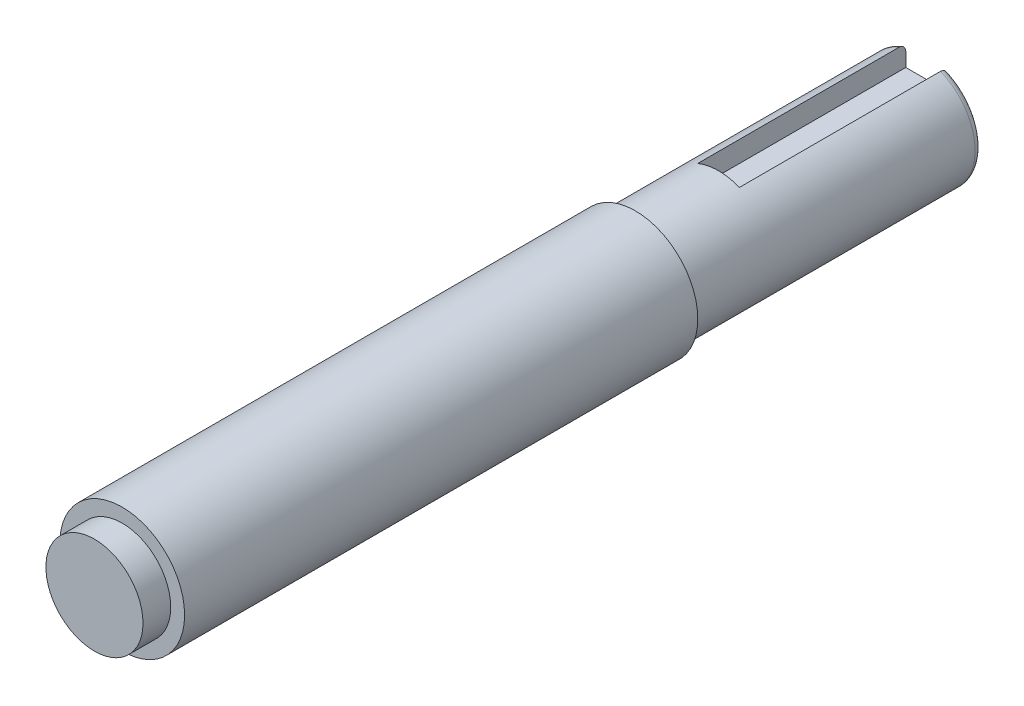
ISO-10303-21;
HEADER;
FILE_DESCRIPTION(('STEP AP214'),'2;1');
FILE_NAME('part.step','',(''),(''),'','','');
FILE_SCHEMA(('AUTOMOTIVE_DESIGN { 1 0 10303 214 1 1 1 1 }'));
ENDSEC;
DATA;
#1=APPLICATION_CONTEXT('core data for automotive mechanical design processes');
#2=APPLICATION_PROTOCOL_DEFINITION('international standard','automotive_design',2000,#1);
#3=PRODUCT_CONTEXT('',#1,'mechanical');
#4=PRODUCT('Part','Part','',(#3));
#5=PRODUCT_RELATED_PRODUCT_CATEGORY('part','',(#4));
#6=PRODUCT_DEFINITION_FORMATION('','',#4);
#7=PRODUCT_DEFINITION_CONTEXT('part definition',#1,'design');
#8=PRODUCT_DEFINITION('design','',#6,#7);
#9=PRODUCT_DEFINITION_SHAPE('','',#8);
#10=(LENGTH_UNIT() NAMED_UNIT(*) SI_UNIT(.MILLI.,.METRE.));
#11=(NAMED_UNIT(*) PLANE_ANGLE_UNIT() SI_UNIT($,.RADIAN.));
#12=(NAMED_UNIT(*) SI_UNIT($,.STERADIAN.) SOLID_ANGLE_UNIT());
#13=UNCERTAINTY_MEASURE_WITH_UNIT(LENGTH_MEASURE(1.E-05),#10,'distance_accuracy_value','');
#14=(GEOMETRIC_REPRESENTATION_CONTEXT(3) GLOBAL_UNCERTAINTY_ASSIGNED_CONTEXT((#13)) GLOBAL_UNIT_ASSIGNED_CONTEXT((#10,
#11,#12)) REPRESENTATION_CONTEXT('',''));
#15=CARTESIAN_POINT('',(0.,0.,0.));
#16=DIRECTION('',(0.,0.,1.));
#17=DIRECTION('',(1.,0.,0.));
#18=AXIS2_PLACEMENT_3D('',#15,#16,#17);
#19=CARTESIAN_POINT('',(0.,0.,58.));
#20=DIRECTION('',(0.,0.,1.));
#21=DIRECTION('',(1.,0.,0.));
#22=AXIS2_PLACEMENT_3D('',#19,#20,#21);
#23=PLANE('',#22);
#24=CARTESIAN_POINT('',(0.,0.,58.));
#25=DIRECTION('',(0.,0.,1.));
#26=DIRECTION('',(1.,0.,0.));
#27=AXIS2_PLACEMENT_3D('',#24,#25,#26);
#28=CIRCLE('',#27,4.5);
#29=CARTESIAN_POINT('',(4.5,0.,58.));
#30=VERTEX_POINT('',#29);
#31=EDGE_CURVE('E125',#30,#30,#28,.T.);
#32=ORIENTED_EDGE('',*,*,#31,.T.);
#33=EDGE_LOOP('',(#32));
#34=FACE_BOUND('',#33,.T.);
#35=CARTESIAN_POINT('',(0.,0.,58.));
#36=DIRECTION('',(0.,0.,1.));
#37=DIRECTION('',(1.,0.,0.));
#38=AXIS2_PLACEMENT_3D('',#35,#36,#37);
#39=CIRCLE('',#38,3.5);
#40=CARTESIAN_POINT('',(3.5,0.,58.));
#41=VERTEX_POINT('',#40);
#42=EDGE_CURVE('E110',#41,#41,#39,.T.);
#43=ORIENTED_EDGE('',*,*,#42,.F.);
#44=EDGE_LOOP('',(#43));
#45=FACE_BOUND('',#44,.T.);
#46=ADVANCED_FACE('F32',(#34,#45),#23,.T.);
#47=CARTESIAN_POINT('',(0.,0.,21.));
#48=DIRECTION('',(0.,0.,-1.));
#49=DIRECTION('',(-1.,0.,0.));
#50=AXIS2_PLACEMENT_3D('',#47,#48,#49);
#51=CYLINDRICAL_SURFACE('',#50,4.);
#52=DIRECTION('',(0.,0.,-1.));
#53=VECTOR('',#52,1.);
#54=CARTESIAN_POINT('',(-1.5,3.70809924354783,15.));
#55=LINE('',#54,#53);
#56=CARTESIAN_POINT('',(-1.5,3.70809924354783,15.));
#57=VERTEX_POINT('',#56);
#58=CARTESIAN_POINT('',(-1.5,3.70809924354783,0.499999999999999));
#59=VERTEX_POINT('',#58);
#60=EDGE_CURVE('E92',#57,#59,#55,.T.);
#61=ORIENTED_EDGE('',*,*,#60,.T.);
#62=CARTESIAN_POINT('',(0.,0.,0.5));
#63=DIRECTION('',(0.,0.,1.));
#64=DIRECTION('',(1.,0.,0.));
#65=AXIS2_PLACEMENT_3D('',#62,#63,#64);
#66=CIRCLE('',#65,4.);
#67=CARTESIAN_POINT('',(1.5,3.70809924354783,0.499999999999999));
#68=VERTEX_POINT('',#67);
#69=EDGE_CURVE('E133',#59,#68,#66,.T.);
#70=ORIENTED_EDGE('',*,*,#69,.T.);
#71=DIRECTION('',(0.,0.,-1.));
#72=VECTOR('',#71,1.);
#73=CARTESIAN_POINT('',(1.5,3.70809924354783,15.));
#74=LINE('',#73,#72);
#75=CARTESIAN_POINT('',(1.5,3.70809924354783,15.));
#76=VERTEX_POINT('',#75);
#77=EDGE_CURVE('E122',#76,#68,#74,.T.);
#78=ORIENTED_EDGE('',*,*,#77,.F.);
#79=CARTESIAN_POINT('',(0.,0.,15.));
#80=DIRECTION('',(0.,0.,-1.));
#81=DIRECTION('',(-1.,0.,0.));
#82=AXIS2_PLACEMENT_3D('',#79,#80,#81);
#83=CIRCLE('',#82,4.);
#84=EDGE_CURVE('E102',#57,#76,#83,.T.);
#85=ORIENTED_EDGE('',*,*,#84,.F.);
#86=EDGE_LOOP('',(#61,#70,#78,#85));
#87=FACE_BOUND('',#86,.T.);
#88=CARTESIAN_POINT('',(0.,0.,21.));
#89=DIRECTION('',(0.,0.,1.));
#90=DIRECTION('',(1.,0.,0.));
#91=AXIS2_PLACEMENT_3D('',#88,#89,#90);
#92=CIRCLE('',#91,4.);
#93=CARTESIAN_POINT('',(4.,0.,21.));
#94=VERTEX_POINT('',#93);
#95=EDGE_CURVE('E128',#94,#94,#92,.T.);
#96=ORIENTED_EDGE('',*,*,#95,.F.);
#97=EDGE_LOOP('',(#96));
#98=FACE_BOUND('',#97,.T.);
#99=ADVANCED_FACE('F150',(#87,#98),#51,.T.);
#100=CARTESIAN_POINT('',(0.,0.,0.));
#101=DIRECTION('',(0.,0.,1.));
#102=DIRECTION('',(1.,0.,0.));
#103=AXIS2_PLACEMENT_3D('',#100,#101,#102);
#104=PLANE('',#103);
#105=DIRECTION('',(0.,-1.,0.));
#106=VECTOR('',#105,1.);
#107=CARTESIAN_POINT('',(1.5,2.2,0.));
#108=LINE('',#107,#106);
#109=CARTESIAN_POINT('',(1.5,3.16227766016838,0.));
#110=VERTEX_POINT('',#109);
#111=CARTESIAN_POINT('',(1.5,2.2,0.));
#112=VERTEX_POINT('',#111);
#113=EDGE_CURVE('E107',#110,#112,#108,.T.);
#114=ORIENTED_EDGE('',*,*,#113,.F.);
#115=CARTESIAN_POINT('',(0.,0.,0.));
#116=DIRECTION('',(0.,0.,1.));
#117=DIRECTION('',(1.,0.,0.));
#118=AXIS2_PLACEMENT_3D('',#115,#116,#117);
#119=CIRCLE('',#118,3.5);
#120=CARTESIAN_POINT('',(-1.5,3.16227766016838,0.));
#121=VERTEX_POINT('',#120);
#122=EDGE_CURVE('E45',#110,#121,#119,.F.);
#123=ORIENTED_EDGE('',*,*,#122,.T.);
#124=DIRECTION('',(0.,1.,0.));
#125=VECTOR('',#124,1.);
#126=CARTESIAN_POINT('',(-1.5,2.2,0.));
#127=LINE('',#126,#125);
#128=CARTESIAN_POINT('',(-1.5,2.2,0.));
#129=VERTEX_POINT('',#128);
#130=EDGE_CURVE('E115',#129,#121,#127,.T.);
#131=ORIENTED_EDGE('',*,*,#130,.F.);
#132=DIRECTION('',(-1.,0.,0.));
#133=VECTOR('',#132,1.);
#134=CARTESIAN_POINT('',(1.5,2.2,0.));
#135=LINE('',#134,#133);
#136=EDGE_CURVE('E90',#112,#129,#135,.T.);
#137=ORIENTED_EDGE('',*,*,#136,.F.);
#138=EDGE_LOOP('',(#114,#123,#131,#137));
#139=FACE_BOUND('',#138,.T.);
#140=ADVANCED_FACE('F156',(#139),#104,.F.);
#141=CARTESIAN_POINT('',(0.,0.,21.));
#142=DIRECTION('',(0.,0.,1.));
#143=DIRECTION('',(1.,0.,0.));
#144=AXIS2_PLACEMENT_3D('',#141,#142,#143);
#145=PLANE('',#144);
#146=CARTESIAN_POINT('',(0.,0.,21.));
#147=DIRECTION('',(0.,0.,1.));
#148=DIRECTION('',(1.,0.,0.));
#149=AXIS2_PLACEMENT_3D('',#146,#147,#148);
#150=CIRCLE('',#149,4.5);
#151=CARTESIAN_POINT('',(4.5,0.,21.));
#152=VERTEX_POINT('',#151);
#153=EDGE_CURVE('E121',#152,#152,#150,.T.);
#154=ORIENTED_EDGE('',*,*,#153,.F.);
#155=EDGE_LOOP('',(#154));
#156=FACE_BOUND('',#155,.T.);
#157=ORIENTED_EDGE('',*,*,#95,.T.);
#158=EDGE_LOOP('',(#157));
#159=FACE_BOUND('',#158,.T.);
#160=ADVANCED_FACE('F152',(#156,#159),#145,.F.);
#161=CARTESIAN_POINT('',(0.,0.,58.));
#162=DIRECTION('',(0.,0.,-1.));
#163=DIRECTION('',(-1.,0.,0.));
#164=AXIS2_PLACEMENT_3D('',#161,#162,#163);
#165=CYLINDRICAL_SURFACE('',#164,4.5);
#166=ORIENTED_EDGE('',*,*,#31,.F.);
#167=EDGE_LOOP('',(#166));
#168=FACE_BOUND('',#167,.T.);
#169=ORIENTED_EDGE('',*,*,#153,.T.);
#170=EDGE_LOOP('',(#169));
#171=FACE_BOUND('',#170,.T.);
#172=ADVANCED_FACE('F155',(#168,#171),#165,.T.);
#173=CARTESIAN_POINT('',(1.5,2.2,15.));
#174=DIRECTION('',(0.,-1.,0.));
#175=DIRECTION('',(0.,0.,-1.));
#176=AXIS2_PLACEMENT_3D('',#173,#174,#175);
#177=PLANE('',#176);
#178=ORIENTED_EDGE('',*,*,#136,.T.);
#179=DIRECTION('',(0.,0.,-1.));
#180=VECTOR('',#179,1.);
#181=CARTESIAN_POINT('',(-1.5,2.2,15.));
#182=LINE('',#181,#180);
#183=CARTESIAN_POINT('',(-1.5,2.2,15.));
#184=VERTEX_POINT('',#183);
#185=EDGE_CURVE('E82',#184,#129,#182,.T.);
#186=ORIENTED_EDGE('',*,*,#185,.F.);
#187=DIRECTION('',(-1.,0.,0.));
#188=VECTOR('',#187,1.);
#189=CARTESIAN_POINT('',(0.,2.2,15.));
#190=LINE('',#189,#188);
#191=CARTESIAN_POINT('',(1.5,2.2,15.));
#192=VERTEX_POINT('',#191);
#193=EDGE_CURVE('E87',#192,#184,#190,.T.);
#194=ORIENTED_EDGE('',*,*,#193,.F.);
#195=DIRECTION('',(0.,0.,-1.));
#196=VECTOR('',#195,1.);
#197=CARTESIAN_POINT('',(1.5,2.2,15.));
#198=LINE('',#197,#196);
#199=EDGE_CURVE('E119',#192,#112,#198,.T.);
#200=ORIENTED_EDGE('',*,*,#199,.T.);
#201=EDGE_LOOP('',(#178,#186,#194,#200));
#202=FACE_BOUND('',#201,.T.);
#203=ADVANCED_FACE('F84',(#202),#177,.F.);
#204=CARTESIAN_POINT('',(1.5,2.2,15.));
#205=DIRECTION('',(1.,0.,0.));
#206=DIRECTION('',(0.,0.,-1.));
#207=AXIS2_PLACEMENT_3D('',#204,#205,#206);
#208=PLANE('',#207);
#209=ORIENTED_EDGE('',*,*,#77,.T.);
#210=CARTESIAN_POINT('',(1.5,3.70809924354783,0.499999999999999));
#211=CARTESIAN_POINT('',(1.5,3.70813027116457,0.473403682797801));
#212=CARTESIAN_POINT('',(1.5,3.70581227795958,0.446824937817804));
#213=CARTESIAN_POINT('',(1.5,3.6967197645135,0.394510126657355));
#214=CARTESIAN_POINT('',(1.5,3.68995695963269,0.368772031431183));
#215=CARTESIAN_POINT('',(1.5,3.67221543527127,0.318802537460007));
#216=CARTESIAN_POINT('',(1.5,3.66123736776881,0.294570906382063));
#217=CARTESIAN_POINT('',(1.5,3.6354746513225,0.248222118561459));
#218=CARTESIAN_POINT('',(1.5,3.62068869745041,0.226105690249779));
#219=CARTESIAN_POINT('',(1.5,3.58735563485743,0.183925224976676));
#220=CARTESIAN_POINT('',(1.5,3.56871657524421,0.163934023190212));
#221=CARTESIAN_POINT('',(1.5,3.52854276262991,0.127120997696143));
#222=CARTESIAN_POINT('',(1.5,3.50700751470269,0.110299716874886));
#223=CARTESIAN_POINT('',(1.5,3.46008441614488,0.0790525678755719));
#224=CARTESIAN_POINT('',(1.5,3.43453321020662,0.0648723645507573));
#225=CARTESIAN_POINT('',(1.5,3.38153554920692,0.0406267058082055));
#226=CARTESIAN_POINT('',(1.5,3.35408772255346,0.0305642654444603));
#227=CARTESIAN_POINT('',(1.5,3.29942896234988,0.015050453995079));
#228=CARTESIAN_POINT('',(1.5,3.27227623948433,0.00939163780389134));
#229=CARTESIAN_POINT('',(1.5,3.21750424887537,0.00186674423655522));
#230=CARTESIAN_POINT('',(1.5,3.18988603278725,-6.96117895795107E-06));
#231=CARTESIAN_POINT('',(1.5,3.16227766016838,0.));
#232=B_SPLINE_CURVE_WITH_KNOTS('',3,(#210,#211,#212,#213,#214,#215,#216,#217,#218,#219,#220,
#221,#222,#223,#224,#225,#226,#227,#228,#229,#230,#231),.UNSPECIFIED.,.F.,.F.,(4,2,2,2,2,2,2,2,
2,2,4),(0.,0.0796609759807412,0.159112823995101,0.238552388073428,0.318019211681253,
0.399663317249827,0.481321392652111,0.568618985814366,0.655980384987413,0.738924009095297,
0.82170031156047),.UNSPECIFIED.);
#233=EDGE_CURVE('E59',#68,#110,#232,.T.);
#234=ORIENTED_EDGE('',*,*,#233,.T.);
#235=ORIENTED_EDGE('',*,*,#113,.T.);
#236=ORIENTED_EDGE('',*,*,#199,.F.);
#237=DIRECTION('',(0.,-1.,0.));
#238=VECTOR('',#237,1.);
#239=CARTESIAN_POINT('',(1.5,2.2,15.));
#240=LINE('',#239,#238);
#241=EDGE_CURVE('E93',#76,#192,#240,.T.);
#242=ORIENTED_EDGE('',*,*,#241,.F.);
#243=EDGE_LOOP('',(#209,#234,#235,#236,#242));
#244=FACE_BOUND('',#243,.T.);
#245=ADVANCED_FACE('F140',(#244),#208,.F.);
#246=CARTESIAN_POINT('',(-1.5,2.2,15.));
#247=DIRECTION('',(-1.,0.,0.));
#248=DIRECTION('',(0.,0.,1.));
#249=AXIS2_PLACEMENT_3D('',#246,#247,#248);
#250=PLANE('',#249);
#251=ORIENTED_EDGE('',*,*,#130,.T.);
#252=CARTESIAN_POINT('',(-1.5,3.16227766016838,0.));
#253=CARTESIAN_POINT('',(-1.5,3.19537872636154,-1.69027962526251E-05));
#254=CARTESIAN_POINT('',(-1.5,3.22850511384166,0.00268331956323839));
#255=CARTESIAN_POINT('',(-1.5,3.29395448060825,0.0135239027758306));
#256=CARTESIAN_POINT('',(-1.5,3.32627472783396,0.0216806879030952));
#257=CARTESIAN_POINT('',(-1.5,3.38911369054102,0.0434637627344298));
#258=CARTESIAN_POINT('',(-1.5,3.41962837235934,0.0571018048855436));
#259=CARTESIAN_POINT('',(-1.5,3.47767519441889,0.0896401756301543));
#260=CARTESIAN_POINT('',(-1.5,3.50521155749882,0.108532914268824));
#261=CARTESIAN_POINT('',(-1.5,3.55457317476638,0.149789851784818));
#262=CARTESIAN_POINT('',(-1.5,3.57665334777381,0.171848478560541));
#263=CARTESIAN_POINT('',(-1.5,3.61638202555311,0.219674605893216));
#264=CARTESIAN_POINT('',(-1.5,3.6340306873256,0.245441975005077));
#265=CARTESIAN_POINT('',(-1.5,3.66279518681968,0.297548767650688));
#266=CARTESIAN_POINT('',(-1.5,3.67433944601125,0.323652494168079));
#267=CARTESIAN_POINT('',(-1.5,3.69253595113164,0.377490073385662));
#268=CARTESIAN_POINT('',(-1.5,3.69919715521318,0.405220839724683));
#269=CARTESIAN_POINT('',(-1.5,3.70488295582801,0.444341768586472));
#270=CARTESIAN_POINT('',(-1.5,3.70608903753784,0.455448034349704));
#271=CARTESIAN_POINT('',(-1.5,3.7076962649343,0.477700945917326));
#272=CARTESIAN_POINT('',(-1.5,3.70809868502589,0.488847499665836));
#273=CARTESIAN_POINT('',(-1.5,3.70809924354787,0.499999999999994));
#274=B_SPLINE_CURVE_WITH_KNOTS('',3,(#252,#253,#254,#255,#256,#257,#258,#259,#260,#261,#262,
#263,#264,#265,#266,#267,#268,#269,#270,#271,#272,#273),.UNSPECIFIED.,.F.,.F.,(4,2,2,2,2,2,2,2,
2,2,4),(0.,0.0992335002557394,0.198767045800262,0.298515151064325,0.398119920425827,
0.491248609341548,0.584373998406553,0.669566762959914,0.754602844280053,0.788094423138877,
0.821532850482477),.UNSPECIFIED.);
#275=EDGE_CURVE('E11',#121,#59,#274,.T.);
#276=ORIENTED_EDGE('',*,*,#275,.T.);
#277=ORIENTED_EDGE('',*,*,#60,.F.);
#278=DIRECTION('',(0.,1.,0.));
#279=VECTOR('',#278,1.);
#280=CARTESIAN_POINT('',(-1.5,2.2,15.));
#281=LINE('',#280,#279);
#282=EDGE_CURVE('E96',#184,#57,#281,.T.);
#283=ORIENTED_EDGE('',*,*,#282,.F.);
#284=ORIENTED_EDGE('',*,*,#185,.T.);
#285=EDGE_LOOP('',(#251,#276,#277,#283,#284));
#286=FACE_BOUND('',#285,.T.);
#287=ADVANCED_FACE('F97',(#286),#250,.F.);
#288=CARTESIAN_POINT('',(0.,0.,15.));
#289=DIRECTION('',(0.,0.,-1.));
#290=DIRECTION('',(-1.,0.,0.));
#291=AXIS2_PLACEMENT_3D('',#288,#289,#290);
#292=PLANE('',#291);
#293=ORIENTED_EDGE('',*,*,#193,.T.);
#294=ORIENTED_EDGE('',*,*,#282,.T.);
#295=ORIENTED_EDGE('',*,*,#84,.T.);
#296=ORIENTED_EDGE('',*,*,#241,.T.);
#297=EDGE_LOOP('',(#293,#294,#295,#296));
#298=FACE_BOUND('',#297,.T.);
#299=ADVANCED_FACE('F105',(#298),#292,.T.);
#300=CARTESIAN_POINT('',(0.,0.,60.));
#301=DIRECTION('',(0.,0.,-1.));
#302=DIRECTION('',(-1.,0.,0.));
#303=AXIS2_PLACEMENT_3D('',#300,#301,#302);
#304=CYLINDRICAL_SURFACE('',#303,3.5);
#305=CARTESIAN_POINT('',(0.,0.,60.));
#306=DIRECTION('',(0.,0.,1.));
#307=DIRECTION('',(1.,0.,0.));
#308=AXIS2_PLACEMENT_3D('',#305,#306,#307);
#309=CIRCLE('',#308,3.5);
#310=CARTESIAN_POINT('',(3.5,0.,60.));
#311=VERTEX_POINT('',#310);
#312=EDGE_CURVE('E117',#311,#311,#309,.T.);
#313=ORIENTED_EDGE('',*,*,#312,.F.);
#314=EDGE_LOOP('',(#313));
#315=FACE_BOUND('',#314,.T.);
#316=ORIENTED_EDGE('',*,*,#42,.T.);
#317=EDGE_LOOP('',(#316));
#318=FACE_BOUND('',#317,.T.);
#319=ADVANCED_FACE('F179',(#315,#318),#304,.T.);
#320=CARTESIAN_POINT('',(0.,0.,60.));
#321=DIRECTION('',(0.,0.,1.));
#322=DIRECTION('',(1.,0.,0.));
#323=AXIS2_PLACEMENT_3D('',#320,#321,#322);
#324=PLANE('',#323);
#325=ORIENTED_EDGE('',*,*,#312,.T.);
#326=EDGE_LOOP('',(#325));
#327=FACE_BOUND('',#326,.T.);
#328=ADVANCED_FACE('F175',(#327),#324,.T.);
#329=CARTESIAN_POINT('',(0.,0.,0.5));
#330=DIRECTION('',(0.,0.,1.));
#331=DIRECTION('',(1.,0.,0.));
#332=AXIS2_PLACEMENT_3D('',#329,#330,#331);
#333=TOROIDAL_SURFACE('',#332,3.5,0.5);
#334=ORIENTED_EDGE('',*,*,#275,.F.);
#335=ORIENTED_EDGE('',*,*,#122,.F.);
#336=ORIENTED_EDGE('',*,*,#233,.F.);
#337=ORIENTED_EDGE('',*,*,#69,.F.);
#338=EDGE_LOOP('',(#334,#335,#336,#337));
#339=FACE_BOUND('',#338,.T.);
#340=ADVANCED_FACE('F34',(#339),#333,.T.);
#341=CLOSED_SHELL('',(#46,#99,#140,#160,#172,#203,#245,#287,#299,#319,#328,#340));
#342=MANIFOLD_SOLID_BREP('B2',#341);
#343=ADVANCED_BREP_SHAPE_REPRESENTATION('',(#18,#342),#14);
#344=SHAPE_DEFINITION_REPRESENTATION(#9,#343);
ENDSEC;
END-ISO-10303-21;
